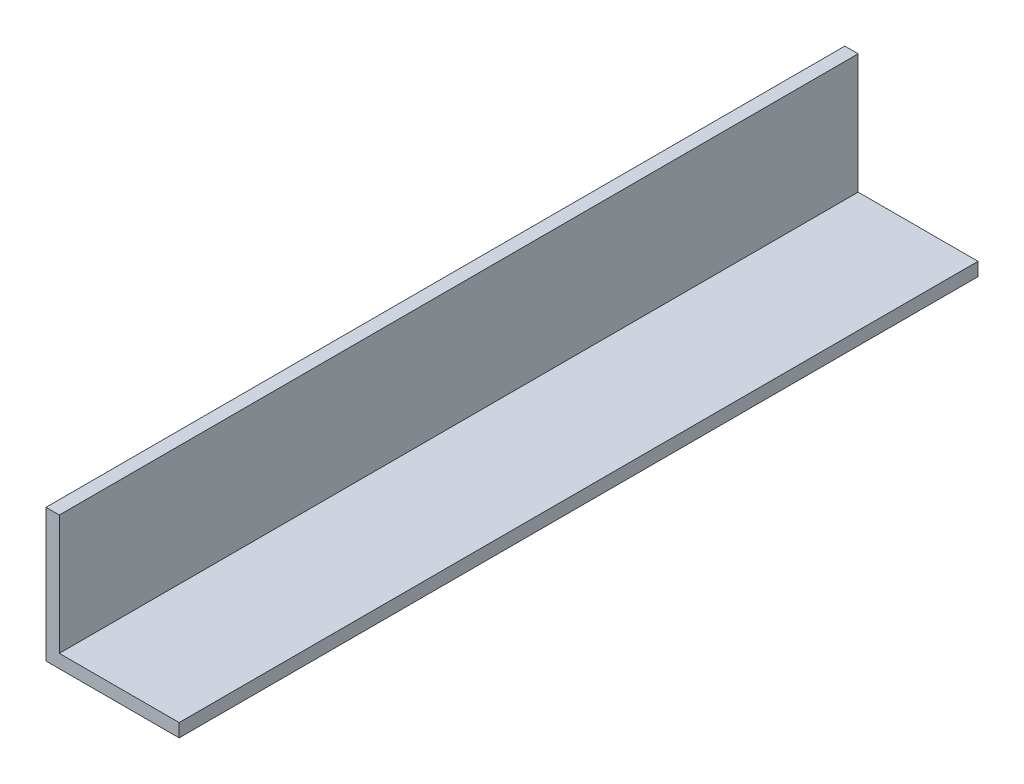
ISO-10303-21;
HEADER;
FILE_DESCRIPTION(('STEP AP214'),'2;1');
FILE_NAME('part.step','',(''),(''),'','','');
FILE_SCHEMA(('AUTOMOTIVE_DESIGN { 1 0 10303 214 1 1 1 1 }'));
ENDSEC;
DATA;
#1=APPLICATION_CONTEXT('core data for automotive mechanical design processes');
#2=APPLICATION_PROTOCOL_DEFINITION('international standard','automotive_design',2000,#1);
#3=PRODUCT_CONTEXT('',#1,'mechanical');
#4=PRODUCT('Part','Part','',(#3));
#5=PRODUCT_RELATED_PRODUCT_CATEGORY('part','',(#4));
#6=PRODUCT_DEFINITION_FORMATION('','',#4);
#7=PRODUCT_DEFINITION_CONTEXT('part definition',#1,'design');
#8=PRODUCT_DEFINITION('design','',#6,#7);
#9=PRODUCT_DEFINITION_SHAPE('','',#8);
#10=(LENGTH_UNIT() NAMED_UNIT(*) SI_UNIT(.MILLI.,.METRE.));
#11=(NAMED_UNIT(*) PLANE_ANGLE_UNIT() SI_UNIT($,.RADIAN.));
#12=(NAMED_UNIT(*) SI_UNIT($,.STERADIAN.) SOLID_ANGLE_UNIT());
#13=UNCERTAINTY_MEASURE_WITH_UNIT(LENGTH_MEASURE(1.E-05),#10,'distance_accuracy_value','');
#14=(GEOMETRIC_REPRESENTATION_CONTEXT(3) GLOBAL_UNCERTAINTY_ASSIGNED_CONTEXT((#13)) GLOBAL_UNIT_ASSIGNED_CONTEXT((#10,
#11,#12)) REPRESENTATION_CONTEXT('',''));
#15=CARTESIAN_POINT('',(0.,0.,0.));
#16=DIRECTION('',(0.,0.,1.));
#17=DIRECTION('',(1.,0.,0.));
#18=AXIS2_PLACEMENT_3D('',#15,#16,#17);
#19=CARTESIAN_POINT('',(45.,0.,150.));
#20=DIRECTION('',(0.,-1.,0.));
#21=DIRECTION('',(1.,0.,0.));
#22=AXIS2_PLACEMENT_3D('',#19,#20,#21);
#23=PLANE('',#22);
#24=DIRECTION('',(-1.,0.,0.));
#25=VECTOR('',#24,1.);
#26=CARTESIAN_POINT('',(45.,0.,-150.));
#27=LINE('',#26,#25);
#28=CARTESIAN_POINT('',(45.,0.,-150.));
#29=VERTEX_POINT('',#28);
#30=CARTESIAN_POINT('',(0.,0.,-150.));
#31=VERTEX_POINT('',#30);
#32=EDGE_CURVE('E120',#29,#31,#27,.T.);
#33=ORIENTED_EDGE('',*,*,#32,.T.);
#34=DIRECTION('',(0.,0.,-1.));
#35=VECTOR('',#34,1.);
#36=CARTESIAN_POINT('',(0.,0.,150.));
#37=LINE('',#36,#35);
#38=CARTESIAN_POINT('',(0.,0.,150.));
#39=VERTEX_POINT('',#38);
#40=EDGE_CURVE('E11',#39,#31,#37,.T.);
#41=ORIENTED_EDGE('',*,*,#40,.F.);
#42=DIRECTION('',(-1.,0.,0.));
#43=VECTOR('',#42,1.);
#44=CARTESIAN_POINT('',(45.,0.,150.));
#45=LINE('',#44,#43);
#46=CARTESIAN_POINT('',(45.,0.,150.));
#47=VERTEX_POINT('',#46);
#48=EDGE_CURVE('E130',#47,#39,#45,.T.);
#49=ORIENTED_EDGE('',*,*,#48,.F.);
#50=DIRECTION('',(0.,0.,-1.));
#51=VECTOR('',#50,1.);
#52=CARTESIAN_POINT('',(45.,0.,150.));
#53=LINE('',#52,#51);
#54=EDGE_CURVE('E116',#47,#29,#53,.T.);
#55=ORIENTED_EDGE('',*,*,#54,.T.);
#56=EDGE_LOOP('',(#33,#41,#49,#55));
#57=FACE_BOUND('',#56,.T.);
#58=ADVANCED_FACE('F36',(#57),#23,.F.);
#59=CARTESIAN_POINT('',(0.,0.,150.));
#60=DIRECTION('',(-1.,0.,0.));
#61=DIRECTION('',(0.,0.,1.));
#62=AXIS2_PLACEMENT_3D('',#59,#60,#61);
#63=PLANE('',#62);
#64=DIRECTION('',(0.,1.,0.));
#65=VECTOR('',#64,1.);
#66=CARTESIAN_POINT('',(0.,0.,-150.));
#67=LINE('',#66,#65);
#68=CARTESIAN_POINT('',(0.,45.,-150.));
#69=VERTEX_POINT('',#68);
#70=EDGE_CURVE('E123',#31,#69,#67,.T.);
#71=ORIENTED_EDGE('',*,*,#70,.T.);
#72=DIRECTION('',(0.,0.,-1.));
#73=VECTOR('',#72,1.);
#74=CARTESIAN_POINT('',(0.,45.,150.));
#75=LINE('',#74,#73);
#76=CARTESIAN_POINT('',(0.,45.,150.));
#77=VERTEX_POINT('',#76);
#78=EDGE_CURVE('E44',#77,#69,#75,.T.);
#79=ORIENTED_EDGE('',*,*,#78,.F.);
#80=DIRECTION('',(0.,1.,0.));
#81=VECTOR('',#80,1.);
#82=CARTESIAN_POINT('',(0.,0.,150.));
#83=LINE('',#82,#81);
#84=EDGE_CURVE('E89',#39,#77,#83,.T.);
#85=ORIENTED_EDGE('',*,*,#84,.F.);
#86=ORIENTED_EDGE('',*,*,#40,.T.);
#87=EDGE_LOOP('',(#71,#79,#85,#86));
#88=FACE_BOUND('',#87,.T.);
#89=ADVANCED_FACE('F154',(#88),#63,.F.);
#90=CARTESIAN_POINT('',(0.,45.,150.));
#91=DIRECTION('',(0.,-1.,0.));
#92=DIRECTION('',(0.,0.,-1.));
#93=AXIS2_PLACEMENT_3D('',#90,#91,#92);
#94=PLANE('',#93);
#95=DIRECTION('',(-1.,0.,0.));
#96=VECTOR('',#95,1.);
#97=CARTESIAN_POINT('',(0.,45.,-150.));
#98=LINE('',#97,#96);
#99=CARTESIAN_POINT('',(-5.,45.,-150.));
#100=VERTEX_POINT('',#99);
#101=EDGE_CURVE('E125',#69,#100,#98,.T.);
#102=ORIENTED_EDGE('',*,*,#101,.T.);
#103=DIRECTION('',(0.,0.,-1.));
#104=VECTOR('',#103,1.);
#105=CARTESIAN_POINT('',(-5.,45.,150.));
#106=LINE('',#105,#104);
#107=CARTESIAN_POINT('',(-5.,45.,150.));
#108=VERTEX_POINT('',#107);
#109=EDGE_CURVE('E111',#108,#100,#106,.T.);
#110=ORIENTED_EDGE('',*,*,#109,.F.);
#111=DIRECTION('',(-1.,0.,0.));
#112=VECTOR('',#111,1.);
#113=CARTESIAN_POINT('',(0.,45.,150.));
#114=LINE('',#113,#112);
#115=EDGE_CURVE('E102',#77,#108,#114,.T.);
#116=ORIENTED_EDGE('',*,*,#115,.F.);
#117=ORIENTED_EDGE('',*,*,#78,.T.);
#118=EDGE_LOOP('',(#102,#110,#116,#117));
#119=FACE_BOUND('',#118,.T.);
#120=ADVANCED_FACE('F136',(#119),#94,.F.);
#121=CARTESIAN_POINT('',(-5.,45.,150.));
#122=DIRECTION('',(1.,0.,0.));
#123=DIRECTION('',(0.,1.,0.));
#124=AXIS2_PLACEMENT_3D('',#121,#122,#123);
#125=PLANE('',#124);
#126=DIRECTION('',(0.,-1.,0.));
#127=VECTOR('',#126,1.);
#128=CARTESIAN_POINT('',(-5.,45.,-150.));
#129=LINE('',#128,#127);
#130=CARTESIAN_POINT('',(-4.99999999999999,-5.,-150.));
#131=VERTEX_POINT('',#130);
#132=EDGE_CURVE('E110',#100,#131,#129,.T.);
#133=ORIENTED_EDGE('',*,*,#132,.T.);
#134=DIRECTION('',(0.,0.,-1.));
#135=VECTOR('',#134,1.);
#136=CARTESIAN_POINT('',(-4.99999999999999,-5.,150.));
#137=LINE('',#136,#135);
#138=CARTESIAN_POINT('',(-4.99999999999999,-5.,150.));
#139=VERTEX_POINT('',#138);
#140=EDGE_CURVE('E107',#139,#131,#137,.T.);
#141=ORIENTED_EDGE('',*,*,#140,.F.);
#142=DIRECTION('',(0.,-1.,0.));
#143=VECTOR('',#142,1.);
#144=CARTESIAN_POINT('',(-5.,45.,150.));
#145=LINE('',#144,#143);
#146=EDGE_CURVE('E96',#108,#139,#145,.T.);
#147=ORIENTED_EDGE('',*,*,#146,.F.);
#148=ORIENTED_EDGE('',*,*,#109,.T.);
#149=EDGE_LOOP('',(#133,#141,#147,#148));
#150=FACE_BOUND('',#149,.T.);
#151=ADVANCED_FACE('F108',(#150),#125,.F.);
#152=CARTESIAN_POINT('',(-4.99999999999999,-5.,150.));
#153=DIRECTION('',(0.,1.,0.));
#154=DIRECTION('',(0.,0.,1.));
#155=AXIS2_PLACEMENT_3D('',#152,#153,#154);
#156=PLANE('',#155);
#157=DIRECTION('',(1.,0.,0.));
#158=VECTOR('',#157,1.);
#159=CARTESIAN_POINT('',(-4.99999999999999,-5.,-150.));
#160=LINE('',#159,#158);
#161=CARTESIAN_POINT('',(45.,-5.,-150.));
#162=VERTEX_POINT('',#161);
#163=EDGE_CURVE('E75',#131,#162,#160,.T.);
#164=ORIENTED_EDGE('',*,*,#163,.T.);
#165=DIRECTION('',(0.,0.,-1.));
#166=VECTOR('',#165,1.);
#167=CARTESIAN_POINT('',(45.,-5.,150.));
#168=LINE('',#167,#166);
#169=CARTESIAN_POINT('',(45.,-5.,150.));
#170=VERTEX_POINT('',#169);
#171=EDGE_CURVE('E112',#170,#162,#168,.T.);
#172=ORIENTED_EDGE('',*,*,#171,.F.);
#173=DIRECTION('',(1.,0.,0.));
#174=VECTOR('',#173,1.);
#175=CARTESIAN_POINT('',(-4.99999999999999,-5.,150.));
#176=LINE('',#175,#174);
#177=EDGE_CURVE('E100',#139,#170,#176,.T.);
#178=ORIENTED_EDGE('',*,*,#177,.F.);
#179=ORIENTED_EDGE('',*,*,#140,.T.);
#180=EDGE_LOOP('',(#164,#172,#178,#179));
#181=FACE_BOUND('',#180,.T.);
#182=ADVANCED_FACE('F114',(#181),#156,.F.);
#183=CARTESIAN_POINT('',(45.,-5.,150.));
#184=DIRECTION('',(-1.,0.,0.));
#185=DIRECTION('',(0.,0.,1.));
#186=AXIS2_PLACEMENT_3D('',#183,#184,#185);
#187=PLANE('',#186);
#188=DIRECTION('',(0.,1.,0.));
#189=VECTOR('',#188,1.);
#190=CARTESIAN_POINT('',(45.,-5.,-150.));
#191=LINE('',#190,#189);
#192=EDGE_CURVE('E81',#162,#29,#191,.T.);
#193=ORIENTED_EDGE('',*,*,#192,.T.);
#194=ORIENTED_EDGE('',*,*,#54,.F.);
#195=DIRECTION('',(0.,1.,0.));
#196=VECTOR('',#195,1.);
#197=CARTESIAN_POINT('',(45.,-5.,150.));
#198=LINE('',#197,#196);
#199=EDGE_CURVE('E52',#170,#47,#198,.T.);
#200=ORIENTED_EDGE('',*,*,#199,.F.);
#201=ORIENTED_EDGE('',*,*,#171,.T.);
#202=EDGE_LOOP('',(#193,#194,#200,#201));
#203=FACE_BOUND('',#202,.T.);
#204=ADVANCED_FACE('F143',(#203),#187,.F.);
#205=CARTESIAN_POINT('',(0.,0.,150.));
#206=DIRECTION('',(0.,0.,-1.));
#207=DIRECTION('',(-1.,0.,0.));
#208=AXIS2_PLACEMENT_3D('',#205,#206,#207);
#209=PLANE('',#208);
#210=ORIENTED_EDGE('',*,*,#48,.T.);
#211=ORIENTED_EDGE('',*,*,#84,.T.);
#212=ORIENTED_EDGE('',*,*,#115,.T.);
#213=ORIENTED_EDGE('',*,*,#146,.T.);
#214=ORIENTED_EDGE('',*,*,#177,.T.);
#215=ORIENTED_EDGE('',*,*,#199,.T.);
#216=EDGE_LOOP('',(#210,#211,#212,#213,#214,#215));
#217=FACE_BOUND('',#216,.T.);
#218=ADVANCED_FACE('F98',(#217),#209,.F.);
#219=CARTESIAN_POINT('',(0.,0.,-150.));
#220=DIRECTION('',(0.,0.,-1.));
#221=DIRECTION('',(-1.,0.,0.));
#222=AXIS2_PLACEMENT_3D('',#219,#220,#221);
#223=PLANE('',#222);
#224=ORIENTED_EDGE('',*,*,#32,.F.);
#225=ORIENTED_EDGE('',*,*,#192,.F.);
#226=ORIENTED_EDGE('',*,*,#163,.F.);
#227=ORIENTED_EDGE('',*,*,#132,.F.);
#228=ORIENTED_EDGE('',*,*,#101,.F.);
#229=ORIENTED_EDGE('',*,*,#70,.F.);
#230=EDGE_LOOP('',(#224,#225,#226,#227,#228,#229));
#231=FACE_BOUND('',#230,.T.);
#232=ADVANCED_FACE('F139',(#231),#223,.T.);
#233=CLOSED_SHELL('',(#58,#89,#120,#151,#182,#204,#218,#232));
#234=MANIFOLD_SOLID_BREP('B2',#233);
#235=ADVANCED_BREP_SHAPE_REPRESENTATION('',(#18,#234),#14);
#236=SHAPE_DEFINITION_REPRESENTATION(#9,#235);
ENDSEC;
END-ISO-10303-21;
